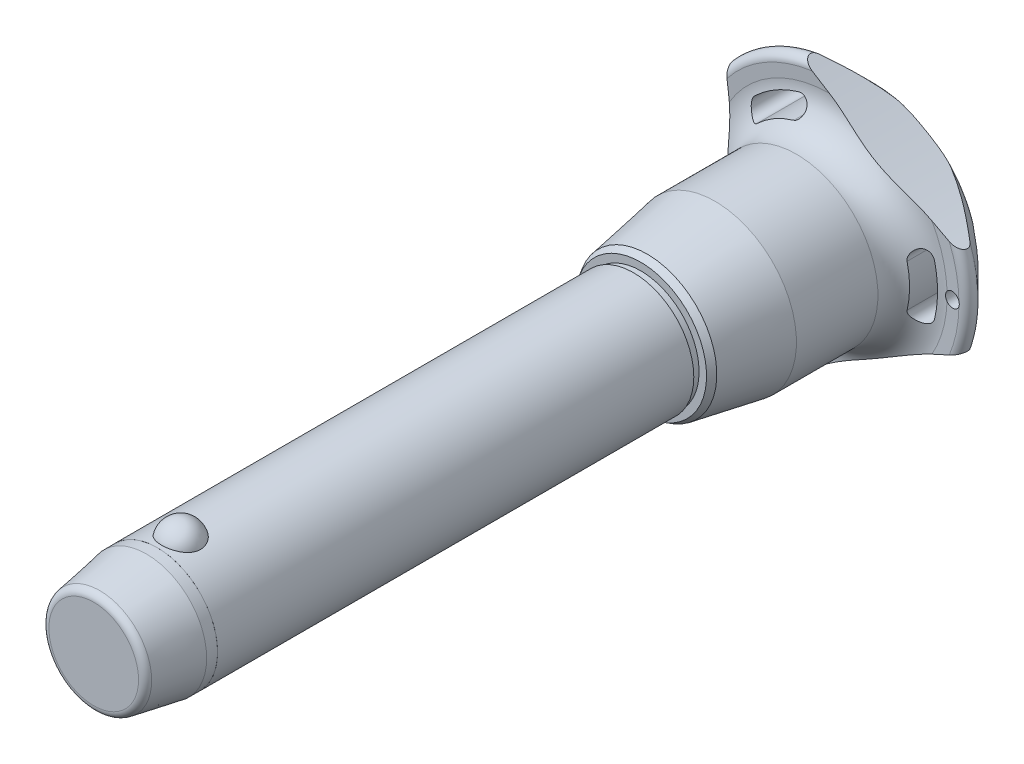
from build123d import *

# Parameters (mm, degrees)
SKETCH1_R           = 12.5
BOSS_EXTRUDE1_DEPTH = 90
SKETCH2_R           = 10
BOSS_EXTRUDE2_DEPTH = 50.7
BOSS_EXTRUDE3_START = 22
SKETCH1_2_R         = 12.5
BOSS_EXTRUDE3_DEPTH = 22
CHAMFER1_SIZE       = 11
CHAMFER1_SIZE2      = 1.939596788
FILLET1_R           = 1.5
SKETCH6_R           = 176.92625
CUT_EXTRUDE1_DEPTH  = 147.379068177
CIRPATTERN1_COUNT   = 3
SKETCH7_R           = 1.5
CUT_EXTRUDE2_DEPTH  = 147.275035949
SKETCH8_R           = 12.5
SKETCH8_R_2         = 12.49
CUT_EXTRUDE3_DEPTH  = 13.2


with BuildPart() as part:
    # Sketch1 → Boss-Extrude1 (new body)
    with BuildSketch(Plane.XY):
        Circle(SKETCH1_R)
    extrude(amount=-BOSS_EXTRUDE1_DEPTH)

    # Sketch2 → Boss-Extrude2 (add)
    with BuildSketch(Plane(origin=(0, 0, -90), x_dir=(-1, 0, 0), z_dir=(0, 0, -1))):
        with Locations(Location((0, 0, 0), (0, 0, 180))):
            Circle(SKETCH2_R)
    extrude(amount=BOSS_EXTRUDE2_DEPTH)

    # Sketch3 → Revolve1 (revolve)
    with BuildSketch(Plane(origin=(0, 0, 0), x_dir=(0, 0, -1), z_dir=(1, 0, 0))):
        with BuildLine():
            Line((-3.957271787, 15.4), (-3.957271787, 7.1))
            ThreePointArc((-3.957271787, 7.1), (0.192728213, 11.25), (-3.957271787, 15.4))
        make_face()
        with BuildLine():
            Line((-3.957271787, -7.1), (-3.957271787, -15.4))
            ThreePointArc((-3.957271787, -15.4), (0.192728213, -11.25), (-3.957271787, -7.1))
        make_face()
    revolve(axis=Axis((0, -7.1, 3.957271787), (0, 1, 0)))

    # Sketch1_2 → Boss-Extrude3 (add)
    with BuildSketch(Plane.XY.offset(BOSS_EXTRUDE3_START)):
        Circle(SKETCH1_2_R)
    extrude(amount=-BOSS_EXTRUDE3_DEPTH)

    # Chamfer1
    chamfer1_edges = [part.edges().sort_by_distance(p)[0] for p in [
        (-12.5, 0, 22),
    ]]
    chamfer1_side = [part.faces().sort_by_distance(p)[0] for p in [
        (-12.5, 0, -34),
    ]]
    chamfer(chamfer1_edges, length=CHAMFER1_SIZE, length2=CHAMFER1_SIZE2, reference=chamfer1_side[0])

    # Fillet1
    fillet1_edges = [part.edges().sort_by_distance(p)[0] for p in [
        (-10.560403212, 0, 22),
        (-10, 0, -140.7),
    ]]
    fillet(fillet1_edges, radius=FILLET1_R)

    # Sketch4 → Revolve2 (revolve)
    with BuildSketch(Plane(origin=(0, 0, 0), x_dir=(0, 0, -1), z_dir=(1, 0, 0)), mode=Mode.PRIVATE) as revolve2_sk:
        Polygon((90, 0), (90, 12.089202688), (91.5, 12.089202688), (91.5, 13.644437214), (92.846872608, 14.422054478), (106.9, 16.9), (123.8, 16.9), (123.8, 0), align=None)
    revolve(revolve2_sk.sketch.rotate(Axis((0, 0, -123.8), (0, 0, 1)), 90), axis=Axis((0, 0, -123.8), (0, 0, 1)))

    # Sketch5 → Revolve3 (revolve)
    with BuildSketch(Plane(origin=(0, 0, 0), x_dir=(0, 0, -1), z_dir=(1, 0, 0)), mode=Mode.PRIVATE) as revolve3_sk:
        with BuildLine():
            Line((130.790129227, 24.271609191), (130.652256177, 26.865060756))
            ThreePointArc((130.652256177, 26.865060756), (131.598671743, 28.411427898), (133.38137085, 28.08137085))
            Line((133.38137085, 28.08137085), (139.763226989, 21.69951471))
            ThreePointArc((139.763226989, 21.69951471), (140.7, 19.381044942), (139.683055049, 17.096604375))
            ThreePointArc((139.683055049, 17.096604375), (134.18864484, 9.321268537), (132.25, 0))
            Line((132.25, 0), (123.8, 0))
            Line((123.8, 0), (123.8, 16.9))
            ThreePointArc((123.8, 16.9), (128.879432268, 19.083427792), (130.790129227, 24.271609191))
        make_face()
    revolve(revolve3_sk.sketch.rotate(Axis((0, 0, -132.25), (0, 0, 1)), 90), axis=Axis((0, 0, -132.25), (0, 0, 1)))

    # Sketch6 → Cut-Extrude1 (cut, through all)
    with BuildSketch(Plane.XY):
        with Locations((-197.42625, 0)):
            Circle(SKETCH6_R)
        with BuildLine():
            ThreePointArc((21.802992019, -5.260839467), (22.428706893, 0), (21.802992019, 5.260839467))
            ThreePointArc((21.802992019, 5.260839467), (19.579234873, 6.620060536), (18.220013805, 4.39630339))
            ThreePointArc((18.220013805, 4.39630339), (18.742902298, 0), (18.220013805, -4.39630339))
            ThreePointArc((18.220013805, -4.39630339), (19.579234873, -6.620060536), (21.802992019, -5.260839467))
        make_face()
    cut_extrude1 = extrude(amount=-CUT_EXTRUDE1_DEPTH, mode=Mode.SUBTRACT)

    # CirPattern1: Cut-Extrude1 ×3 about axis
    cirpattern1_axis = Axis((0, 0, 0), (0, 0, 1))
    for i in range(1, CIRPATTERN1_COUNT):
        add(cut_extrude1.rotate(cirpattern1_axis, i * 360 / CIRPATTERN1_COUNT), mode=Mode.SUBTRACT)

    # Sketch7 → Cut-Extrude2 (cut, through all)
    with BuildSketch(Plane.XY):
        with Locations(Location((25.428706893, 0, 0), (0, 0, 17.230769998))):
            Circle(SKETCH7_R)
    extrude(amount=-CUT_EXTRUDE2_DEPTH, mode=Mode.SUBTRACT)

    # Sketch8 → Cut-Extrude3 (cut)
    with BuildSketch(Plane.XY.offset(22)):
        Circle(SKETCH8_R)
        Circle(SKETCH8_R_2, mode=Mode.SUBTRACT)
    extrude(amount=-CUT_EXTRUDE3_DEPTH, mode=Mode.SUBTRACT)


solid = part.part
